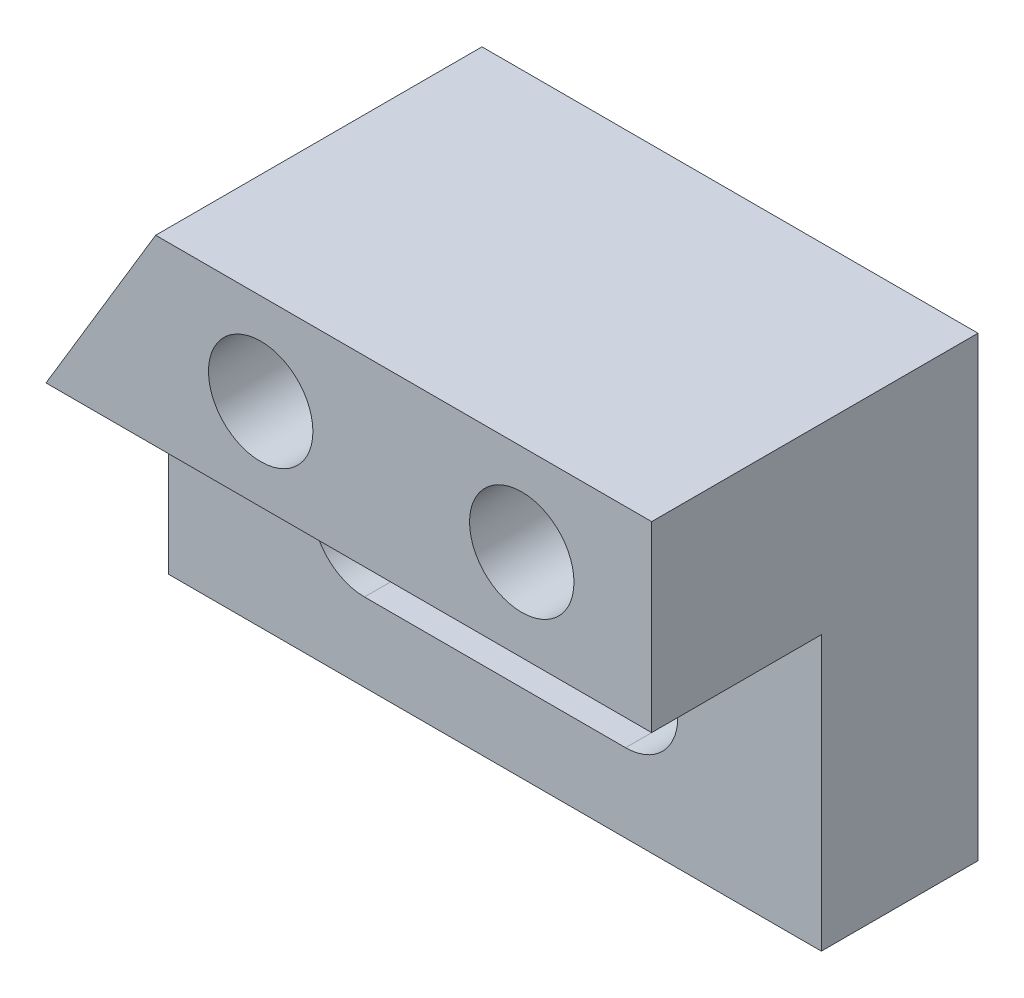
from build123d import *

# Parameters (mm, degrees)
EXTRUDE_1_DEPTH          = 12
EXTRUDE_3_DEPTH          = 25
CUT_EXTRUDE_1_DEPTH      = 66.954529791
CUT_EXTRUDE_1_DEPTH_BACK = 66.954529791
SKETCH_8_R               = 4
CUT_EXTRUDE_2_DEPTH      = 63.401923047


with BuildPart() as part:
    # Sketch 2 → Extrude 1 (new body)
    with BuildSketch(Plane.XY):
        Polygon((0, 0), (50, 0), (50, 15), (50, 35), (12, 35), (0, 15), align=None)
    extrude(amount=EXTRUDE_1_DEPTH)

    # Sketch 7 → Extrude 3 (add)
    with BuildSketch(Plane(origin=(0, 0, 0), x_dir=(-1, 0, 0), z_dir=(0, 0, -1))):
        Polygon((-50, 35), (-50, 21), (-3.6, 21), (-12, 35), align=None)
    extrude(amount=-EXTRUDE_3_DEPTH)

    # Sketch 8 → Cut-Extrude 1 (cut, two sides: drawn at the far end of the back side and taken through both)
    with BuildSketch(Plane.XY.offset(25).offset(-CUT_EXTRUDE_1_DEPTH_BACK)):
        with Locations((40.046910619, 28)):
            Circle(SKETCH_8_R)
        with Locations((20.046910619, 28)):
            Circle(SKETCH_8_R)
    extrude(amount=CUT_EXTRUDE_1_DEPTH + CUT_EXTRUDE_1_DEPTH_BACK, mode=Mode.SUBTRACT)

    # Sketch 9 → Cut-Extrude 2 (cut, through all)
    with BuildSketch(Plane.XY.offset(12)):
        with BuildLine():
            Line((35, 6), (15, 6))
            ThreePointArc((15, 6), (11, 10), (15, 14))
            Line((15, 14), (35, 14))
            ThreePointArc((35, 14), (39, 10), (35, 6))
        make_face()
    extrude(amount=-CUT_EXTRUDE_2_DEPTH, mode=Mode.SUBTRACT)


solid = part.part
